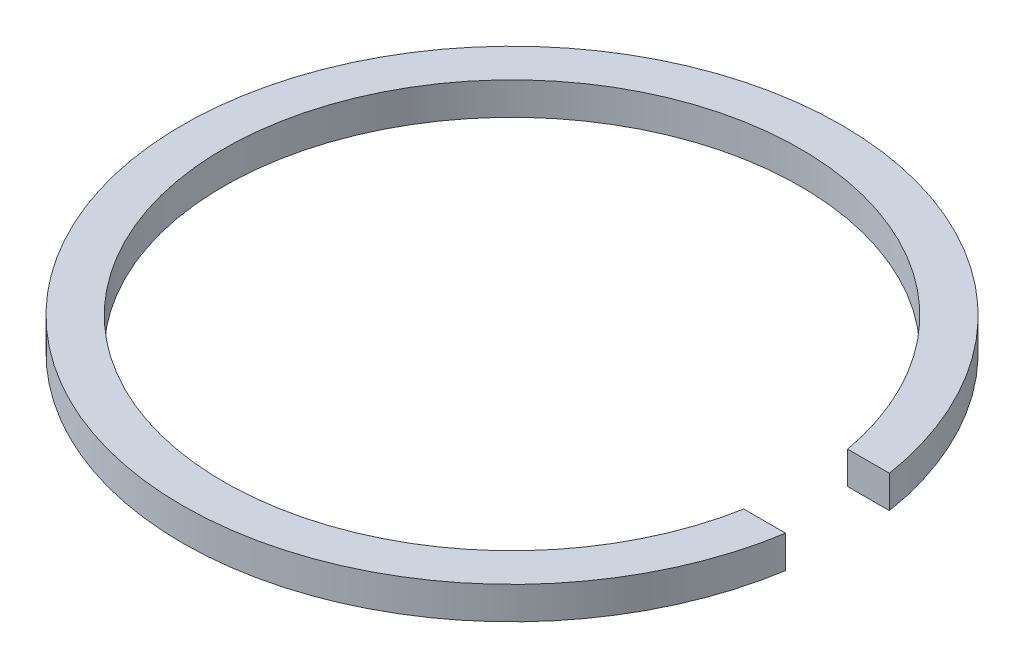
from build123d import *

# Parameters (mm, degrees)
BOSS_EXTRUDE1_DEPTH = 1.25


with BuildPart() as part:
    # Sketch1 → Boss-Extrude1 (new body)
    with BuildSketch(Plane(origin=(0, 0, 0), x_dir=(1, 0, 0), z_dir=(0, 1, 0))):
        with BuildLine():
            ThreePointArc((10.93104095, -2), (-11.1125, 0), (10.93104095, 2))
            Line((10.93104095, 2), (12.541531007, 2))
            ThreePointArc((12.541531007, 2), (-12.7, 0), (12.541531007, -2))
            Line((12.541531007, -2), (10.93104095, -2))
        make_face()
    extrude(amount=BOSS_EXTRUDE1_DEPTH)


solid = part.part
